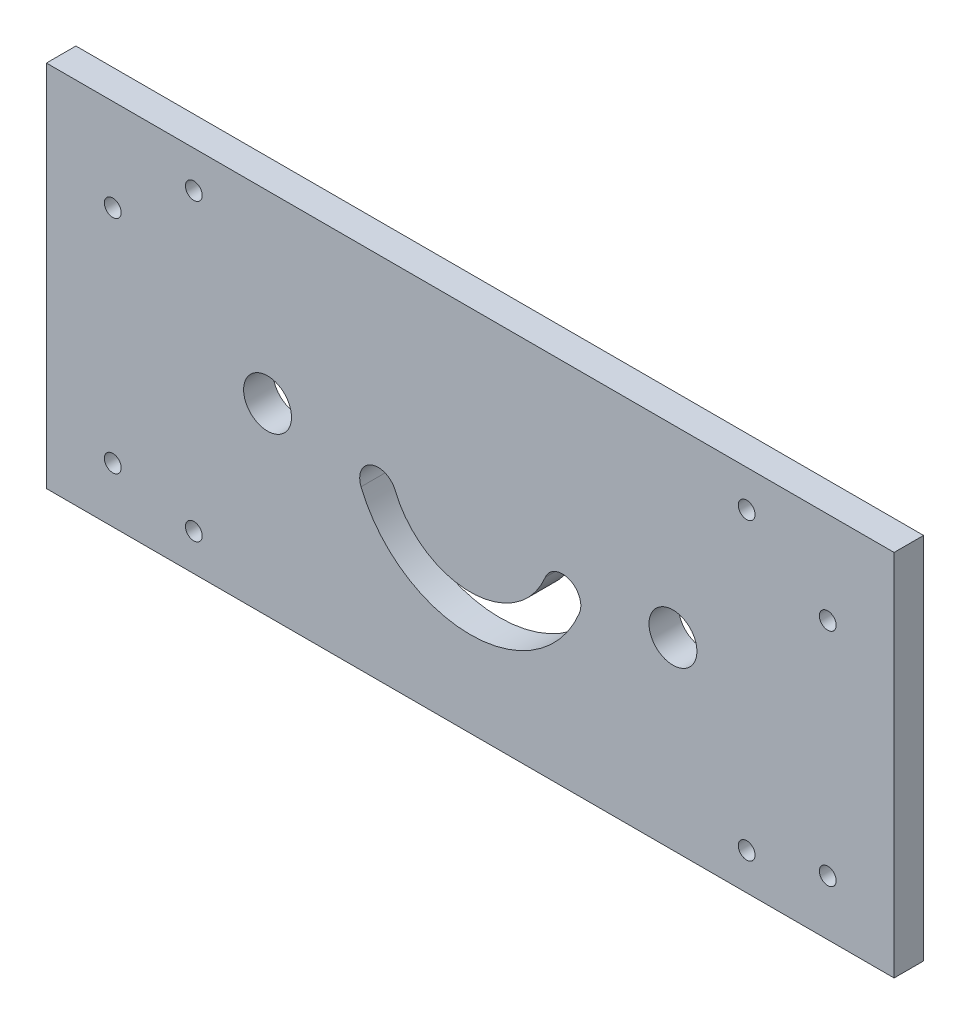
ISO-10303-21;
HEADER;
FILE_DESCRIPTION(('STEP AP214'),'2;1');
FILE_NAME('part.step','',(''),(''),'','','');
FILE_SCHEMA(('AUTOMOTIVE_DESIGN { 1 0 10303 214 1 1 1 1 }'));
ENDSEC;
DATA;
#1=APPLICATION_CONTEXT('core data for automotive mechanical design processes');
#2=APPLICATION_PROTOCOL_DEFINITION('international standard','automotive_design',2000,#1);
#3=PRODUCT_CONTEXT('',#1,'mechanical');
#4=PRODUCT('Part','Part','',(#3));
#5=PRODUCT_RELATED_PRODUCT_CATEGORY('part','',(#4));
#6=PRODUCT_DEFINITION_FORMATION('','',#4);
#7=PRODUCT_DEFINITION_CONTEXT('part definition',#1,'design');
#8=PRODUCT_DEFINITION('design','',#6,#7);
#9=PRODUCT_DEFINITION_SHAPE('','',#8);
#10=(LENGTH_UNIT() NAMED_UNIT(*) SI_UNIT(.MILLI.,.METRE.));
#11=(NAMED_UNIT(*) PLANE_ANGLE_UNIT() SI_UNIT($,.RADIAN.));
#12=(NAMED_UNIT(*) SI_UNIT($,.STERADIAN.) SOLID_ANGLE_UNIT());
#13=UNCERTAINTY_MEASURE_WITH_UNIT(LENGTH_MEASURE(1.E-05),#10,'distance_accuracy_value','');
#14=(GEOMETRIC_REPRESENTATION_CONTEXT(3) GLOBAL_UNCERTAINTY_ASSIGNED_CONTEXT((#13)) GLOBAL_UNIT_ASSIGNED_CONTEXT((#10,
#11,#12)) REPRESENTATION_CONTEXT('',''));
#15=CARTESIAN_POINT('',(0.,0.,0.));
#16=DIRECTION('',(0.,0.,1.));
#17=DIRECTION('',(1.,0.,0.));
#18=AXIS2_PLACEMENT_3D('',#15,#16,#17);
#19=CARTESIAN_POINT('',(0.,0.,8.));
#20=DIRECTION('',(0.,0.,1.));
#21=DIRECTION('',(1.,0.,0.));
#22=AXIS2_PLACEMENT_3D('',#19,#20,#21);
#23=PLANE('',#22);
#24=CARTESIAN_POINT('',(-55.,0.,8.));
#25=DIRECTION('',(0.,0.,1.));
#26=DIRECTION('',(1.,0.,0.));
#27=AXIS2_PLACEMENT_3D('',#24,#25,#26);
#28=CIRCLE('',#27,6.5);
#29=CARTESIAN_POINT('',(-48.5,0.,8.));
#30=VERTEX_POINT('',#29);
#31=EDGE_CURVE('E146',#30,#30,#28,.T.);
#32=ORIENTED_EDGE('',*,*,#31,.F.);
#33=EDGE_LOOP('',(#32));
#34=FACE_BOUND('',#33,.T.);
#35=CARTESIAN_POINT('',(75.,40.,8.));
#36=DIRECTION('',(0.,0.,1.));
#37=DIRECTION('',(1.,0.,0.));
#38=AXIS2_PLACEMENT_3D('',#35,#36,#37);
#39=CIRCLE('',#38,2.28499999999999);
#40=CARTESIAN_POINT('',(77.285,40.,8.));
#41=VERTEX_POINT('',#40);
#42=EDGE_CURVE('E158',#41,#41,#39,.T.);
#43=ORIENTED_EDGE('',*,*,#42,.F.);
#44=EDGE_LOOP('',(#43));
#45=FACE_BOUND('',#44,.T.);
#46=CARTESIAN_POINT('',(97.,-35.,8.));
#47=DIRECTION('',(0.,0.,1.));
#48=DIRECTION('',(-1.,0.,0.));
#49=AXIS2_PLACEMENT_3D('',#46,#47,#48);
#50=CIRCLE('',#49,2.28499999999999);
#51=CARTESIAN_POINT('',(94.715,-35.,8.));
#52=VERTEX_POINT('',#51);
#53=EDGE_CURVE('E170',#52,#52,#50,.T.);
#54=ORIENTED_EDGE('',*,*,#53,.F.);
#55=EDGE_LOOP('',(#54));
#56=FACE_BOUND('',#55,.T.);
#57=CARTESIAN_POINT('',(-97.,25.,8.));
#58=DIRECTION('',(0.,0.,1.));
#59=DIRECTION('',(1.,0.,0.));
#60=AXIS2_PLACEMENT_3D('',#57,#58,#59);
#61=CIRCLE('',#60,2.28499999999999);
#62=CARTESIAN_POINT('',(-94.715,25.,8.));
#63=VERTEX_POINT('',#62);
#64=EDGE_CURVE('E182',#63,#63,#61,.T.);
#65=ORIENTED_EDGE('',*,*,#64,.F.);
#66=EDGE_LOOP('',(#65));
#67=FACE_BOUND('',#66,.T.);
#68=CARTESIAN_POINT('',(-97.,-35.,8.));
#69=DIRECTION('',(0.,0.,1.));
#70=DIRECTION('',(1.,0.,0.));
#71=AXIS2_PLACEMENT_3D('',#68,#69,#70);
#72=CIRCLE('',#71,2.28499999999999);
#73=CARTESIAN_POINT('',(-94.715,-35.,8.));
#74=VERTEX_POINT('',#73);
#75=EDGE_CURVE('E194',#74,#74,#72,.T.);
#76=ORIENTED_EDGE('',*,*,#75,.F.);
#77=EDGE_LOOP('',(#76));
#78=FACE_BOUND('',#77,.T.);
#79=DIRECTION('',(-1.,0.,0.));
#80=VECTOR('',#79,1.);
#81=CARTESIAN_POINT('',(115.,50.,8.));
#82=LINE('',#81,#80);
#83=CARTESIAN_POINT('',(115.,50.,8.));
#84=VERTEX_POINT('',#83);
#85=CARTESIAN_POINT('',(-115.,50.,8.));
#86=VERTEX_POINT('',#85);
#87=EDGE_CURVE('E200',#84,#86,#82,.T.);
#88=ORIENTED_EDGE('',*,*,#87,.T.);
#89=DIRECTION('',(0.,-1.,0.));
#90=VECTOR('',#89,1.);
#91=CARTESIAN_POINT('',(-115.,50.,8.));
#92=LINE('',#91,#90);
#93=CARTESIAN_POINT('',(-115.,-50.,8.));
#94=VERTEX_POINT('',#93);
#95=EDGE_CURVE('E203',#86,#94,#92,.T.);
#96=ORIENTED_EDGE('',*,*,#95,.T.);
#97=DIRECTION('',(1.,0.,0.));
#98=VECTOR('',#97,1.);
#99=CARTESIAN_POINT('',(-115.,-50.,8.));
#100=LINE('',#99,#98);
#101=CARTESIAN_POINT('',(115.,-50.,8.));
#102=VERTEX_POINT('',#101);
#103=EDGE_CURVE('E206',#94,#102,#100,.T.);
#104=ORIENTED_EDGE('',*,*,#103,.T.);
#105=DIRECTION('',(0.,1.,0.));
#106=VECTOR('',#105,1.);
#107=CARTESIAN_POINT('',(115.,-50.,8.));
#108=LINE('',#107,#106);
#109=EDGE_CURVE('E208',#102,#84,#108,.T.);
#110=ORIENTED_EDGE('',*,*,#109,.T.);
#111=EDGE_LOOP('',(#88,#96,#104,#110));
#112=FACE_BOUND('',#111,.T.);
#113=CARTESIAN_POINT('',(-75.,-40.,8.));
#114=DIRECTION('',(0.,0.,1.));
#115=DIRECTION('',(1.,0.,0.));
#116=AXIS2_PLACEMENT_3D('',#113,#114,#115);
#117=CIRCLE('',#116,2.28499999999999);
#118=CARTESIAN_POINT('',(-72.715,-40.,8.));
#119=VERTEX_POINT('',#118);
#120=EDGE_CURVE('E188',#119,#119,#117,.T.);
#121=ORIENTED_EDGE('',*,*,#120,.F.);
#122=EDGE_LOOP('',(#121));
#123=FACE_BOUND('',#122,.T.);
#124=CARTESIAN_POINT('',(75.,-40.,8.));
#125=DIRECTION('',(0.,0.,1.));
#126=DIRECTION('',(-1.,0.,0.));
#127=AXIS2_PLACEMENT_3D('',#124,#125,#126);
#128=CIRCLE('',#127,2.28499999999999);
#129=CARTESIAN_POINT('',(72.715,-40.,8.));
#130=VERTEX_POINT('',#129);
#131=EDGE_CURVE('E176',#130,#130,#128,.T.);
#132=ORIENTED_EDGE('',*,*,#131,.F.);
#133=EDGE_LOOP('',(#132));
#134=FACE_BOUND('',#133,.T.);
#135=CARTESIAN_POINT('',(97.,25.,8.));
#136=DIRECTION('',(0.,0.,1.));
#137=DIRECTION('',(-1.,0.,0.));
#138=AXIS2_PLACEMENT_3D('',#135,#136,#137);
#139=CIRCLE('',#138,2.28499999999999);
#140=CARTESIAN_POINT('',(94.715,25.,8.));
#141=VERTEX_POINT('',#140);
#142=EDGE_CURVE('E164',#141,#141,#139,.T.);
#143=ORIENTED_EDGE('',*,*,#142,.F.);
#144=EDGE_LOOP('',(#143));
#145=FACE_BOUND('',#144,.T.);
#146=CARTESIAN_POINT('',(-75.,40.,8.));
#147=DIRECTION('',(0.,0.,1.));
#148=DIRECTION('',(-1.,0.,0.));
#149=AXIS2_PLACEMENT_3D('',#146,#147,#148);
#150=CIRCLE('',#149,2.28499999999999);
#151=CARTESIAN_POINT('',(-77.285,40.,8.));
#152=VERTEX_POINT('',#151);
#153=EDGE_CURVE('E152',#152,#152,#150,.T.);
#154=ORIENTED_EDGE('',*,*,#153,.F.);
#155=EDGE_LOOP('',(#154));
#156=FACE_BOUND('',#155,.T.);
#157=CARTESIAN_POINT('',(55.,0.,8.));
#158=DIRECTION('',(0.,0.,1.));
#159=DIRECTION('',(-1.,0.,0.));
#160=AXIS2_PLACEMENT_3D('',#157,#158,#159);
#161=CIRCLE('',#160,6.5);
#162=CARTESIAN_POINT('',(48.5,0.,8.));
#163=VERTEX_POINT('',#162);
#164=EDGE_CURVE('E140',#163,#163,#161,.T.);
#165=ORIENTED_EDGE('',*,*,#164,.F.);
#166=EDGE_LOOP('',(#165));
#167=FACE_BOUND('',#166,.T.);
#168=CARTESIAN_POINT('',(0.00750586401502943,5.17961936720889,8.));
#169=DIRECTION('',(0.,0.,1.));
#170=DIRECTION('',(1.,0.,0.));
#171=AXIS2_PLACEMENT_3D('',#168,#169,#170);
#172=CIRCLE('',#171,32.);
#173=CARTESIAN_POINT('',(-29.6310196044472,-6.88511469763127,8.));
#174=VERTEX_POINT('',#173);
#175=CARTESIAN_POINT('',(29.628239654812,-6.92873021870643,8.));
#176=VERTEX_POINT('',#175);
#177=EDGE_CURVE('E112',#174,#176,#172,.T.);
#178=ORIENTED_EDGE('',*,*,#177,.F.);
#179=CARTESIAN_POINT('',(-25.,-5.,8.));
#180=DIRECTION('',(0.,0.,1.));
#181=DIRECTION('',(1.,0.,0.));
#182=AXIS2_PLACEMENT_3D('',#179,#180,#181);
#183=CIRCLE('',#182,5.);
#184=CARTESIAN_POINT('',(-20.3689803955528,-3.11488530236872,8.));
#185=VERTEX_POINT('',#184);
#186=EDGE_CURVE('E104',#185,#174,#183,.T.);
#187=ORIENTED_EDGE('',*,*,#186,.F.);
#188=CARTESIAN_POINT('',(0.00750586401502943,5.17961936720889,8.));
#189=DIRECTION('',(0.,0.,-1.));
#190=DIRECTION('',(1.,0.,0.));
#191=AXIS2_PLACEMENT_3D('',#188,#189,#190);
#192=CIRCLE('',#191,22.);
#193=CARTESIAN_POINT('',(20.371760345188,-3.14487097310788,8.));
#194=VERTEX_POINT('',#193);
#195=EDGE_CURVE('E126',#194,#185,#192,.T.);
#196=ORIENTED_EDGE('',*,*,#195,.F.);
#197=CARTESIAN_POINT('',(25.,-5.03680059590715,8.));
#198=DIRECTION('',(0.,0.,1.));
#199=DIRECTION('',(1.,0.,0.));
#200=AXIS2_PLACEMENT_3D('',#197,#198,#199);
#201=CIRCLE('',#200,5.);
#202=EDGE_CURVE('E124',#176,#194,#201,.T.);
#203=ORIENTED_EDGE('',*,*,#202,.F.);
#204=EDGE_LOOP('',(#178,#187,#196,#203));
#205=FACE_BOUND('',#204,.T.);
#206=ADVANCED_FACE('F39',(#34,#45,#56,#67,#78,#112,#123,#134,#145,#156,#167,#205),#23,.T.);
#207=CARTESIAN_POINT('',(0.,0.,0.));
#208=DIRECTION('',(0.,0.,1.));
#209=DIRECTION('',(1.,0.,0.));
#210=AXIS2_PLACEMENT_3D('',#207,#208,#209);
#211=PLANE('',#210);
#212=CARTESIAN_POINT('',(55.,0.,0.));
#213=DIRECTION('',(0.,0.,1.));
#214=DIRECTION('',(-1.,0.,0.));
#215=AXIS2_PLACEMENT_3D('',#212,#213,#214);
#216=CIRCLE('',#215,6.5);
#217=CARTESIAN_POINT('',(48.5,0.,0.));
#218=VERTEX_POINT('',#217);
#219=EDGE_CURVE('E120',#218,#218,#216,.T.);
#220=ORIENTED_EDGE('',*,*,#219,.T.);
#221=EDGE_LOOP('',(#220));
#222=FACE_BOUND('',#221,.T.);
#223=CARTESIAN_POINT('',(-55.,0.,0.));
#224=DIRECTION('',(0.,0.,1.));
#225=DIRECTION('',(1.,0.,0.));
#226=AXIS2_PLACEMENT_3D('',#223,#224,#225);
#227=CIRCLE('',#226,6.5);
#228=CARTESIAN_POINT('',(-48.5,0.,0.));
#229=VERTEX_POINT('',#228);
#230=EDGE_CURVE('E143',#229,#229,#227,.T.);
#231=ORIENTED_EDGE('',*,*,#230,.T.);
#232=EDGE_LOOP('',(#231));
#233=FACE_BOUND('',#232,.T.);
#234=CARTESIAN_POINT('',(-75.,40.,0.));
#235=DIRECTION('',(0.,0.,1.));
#236=DIRECTION('',(-1.,0.,0.));
#237=AXIS2_PLACEMENT_3D('',#234,#235,#236);
#238=CIRCLE('',#237,2.28499999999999);
#239=CARTESIAN_POINT('',(-77.285,40.,0.));
#240=VERTEX_POINT('',#239);
#241=EDGE_CURVE('E149',#240,#240,#238,.T.);
#242=ORIENTED_EDGE('',*,*,#241,.T.);
#243=EDGE_LOOP('',(#242));
#244=FACE_BOUND('',#243,.T.);
#245=CARTESIAN_POINT('',(75.,40.,0.));
#246=DIRECTION('',(0.,0.,1.));
#247=DIRECTION('',(1.,0.,0.));
#248=AXIS2_PLACEMENT_3D('',#245,#246,#247);
#249=CIRCLE('',#248,2.28499999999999);
#250=CARTESIAN_POINT('',(77.285,40.,0.));
#251=VERTEX_POINT('',#250);
#252=EDGE_CURVE('E155',#251,#251,#249,.T.);
#253=ORIENTED_EDGE('',*,*,#252,.T.);
#254=EDGE_LOOP('',(#253));
#255=FACE_BOUND('',#254,.T.);
#256=CARTESIAN_POINT('',(97.,25.,0.));
#257=DIRECTION('',(0.,0.,1.));
#258=DIRECTION('',(-1.,0.,0.));
#259=AXIS2_PLACEMENT_3D('',#256,#257,#258);
#260=CIRCLE('',#259,2.28499999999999);
#261=CARTESIAN_POINT('',(94.715,25.,0.));
#262=VERTEX_POINT('',#261);
#263=EDGE_CURVE('E161',#262,#262,#260,.T.);
#264=ORIENTED_EDGE('',*,*,#263,.T.);
#265=EDGE_LOOP('',(#264));
#266=FACE_BOUND('',#265,.T.);
#267=CARTESIAN_POINT('',(97.,-35.,0.));
#268=DIRECTION('',(0.,0.,1.));
#269=DIRECTION('',(-1.,0.,0.));
#270=AXIS2_PLACEMENT_3D('',#267,#268,#269);
#271=CIRCLE('',#270,2.28499999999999);
#272=CARTESIAN_POINT('',(94.715,-35.,0.));
#273=VERTEX_POINT('',#272);
#274=EDGE_CURVE('E167',#273,#273,#271,.T.);
#275=ORIENTED_EDGE('',*,*,#274,.T.);
#276=EDGE_LOOP('',(#275));
#277=FACE_BOUND('',#276,.T.);
#278=CARTESIAN_POINT('',(75.,-40.,0.));
#279=DIRECTION('',(0.,0.,1.));
#280=DIRECTION('',(-1.,0.,0.));
#281=AXIS2_PLACEMENT_3D('',#278,#279,#280);
#282=CIRCLE('',#281,2.28499999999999);
#283=CARTESIAN_POINT('',(72.715,-40.,0.));
#284=VERTEX_POINT('',#283);
#285=EDGE_CURVE('E173',#284,#284,#282,.T.);
#286=ORIENTED_EDGE('',*,*,#285,.T.);
#287=EDGE_LOOP('',(#286));
#288=FACE_BOUND('',#287,.T.);
#289=CARTESIAN_POINT('',(-97.,25.,0.));
#290=DIRECTION('',(0.,0.,1.));
#291=DIRECTION('',(1.,0.,0.));
#292=AXIS2_PLACEMENT_3D('',#289,#290,#291);
#293=CIRCLE('',#292,2.28499999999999);
#294=CARTESIAN_POINT('',(-94.715,25.,0.));
#295=VERTEX_POINT('',#294);
#296=EDGE_CURVE('E179',#295,#295,#293,.T.);
#297=ORIENTED_EDGE('',*,*,#296,.T.);
#298=EDGE_LOOP('',(#297));
#299=FACE_BOUND('',#298,.T.);
#300=CARTESIAN_POINT('',(-75.,-40.,0.));
#301=DIRECTION('',(0.,0.,1.));
#302=DIRECTION('',(1.,0.,0.));
#303=AXIS2_PLACEMENT_3D('',#300,#301,#302);
#304=CIRCLE('',#303,2.28499999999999);
#305=CARTESIAN_POINT('',(-72.715,-40.,0.));
#306=VERTEX_POINT('',#305);
#307=EDGE_CURVE('E185',#306,#306,#304,.T.);
#308=ORIENTED_EDGE('',*,*,#307,.T.);
#309=EDGE_LOOP('',(#308));
#310=FACE_BOUND('',#309,.T.);
#311=CARTESIAN_POINT('',(-97.,-35.,0.));
#312=DIRECTION('',(0.,0.,1.));
#313=DIRECTION('',(1.,0.,0.));
#314=AXIS2_PLACEMENT_3D('',#311,#312,#313);
#315=CIRCLE('',#314,2.28499999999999);
#316=CARTESIAN_POINT('',(-94.715,-35.,0.));
#317=VERTEX_POINT('',#316);
#318=EDGE_CURVE('E191',#317,#317,#315,.T.);
#319=ORIENTED_EDGE('',*,*,#318,.T.);
#320=EDGE_LOOP('',(#319));
#321=FACE_BOUND('',#320,.T.);
#322=DIRECTION('',(-1.,0.,0.));
#323=VECTOR('',#322,1.);
#324=CARTESIAN_POINT('',(115.,50.,0.));
#325=LINE('',#324,#323);
#326=CARTESIAN_POINT('',(115.,50.,0.));
#327=VERTEX_POINT('',#326);
#328=CARTESIAN_POINT('',(-115.,50.,0.));
#329=VERTEX_POINT('',#328);
#330=EDGE_CURVE('E197',#327,#329,#325,.T.);
#331=ORIENTED_EDGE('',*,*,#330,.F.);
#332=DIRECTION('',(0.,1.,0.));
#333=VECTOR('',#332,1.);
#334=CARTESIAN_POINT('',(115.,-50.,0.));
#335=LINE('',#334,#333);
#336=CARTESIAN_POINT('',(115.,-50.,0.));
#337=VERTEX_POINT('',#336);
#338=EDGE_CURVE('E204',#337,#327,#335,.T.);
#339=ORIENTED_EDGE('',*,*,#338,.F.);
#340=DIRECTION('',(1.,0.,0.));
#341=VECTOR('',#340,1.);
#342=CARTESIAN_POINT('',(-115.,-50.,0.));
#343=LINE('',#342,#341);
#344=CARTESIAN_POINT('',(-115.,-50.,0.));
#345=VERTEX_POINT('',#344);
#346=EDGE_CURVE('E215',#345,#337,#343,.T.);
#347=ORIENTED_EDGE('',*,*,#346,.F.);
#348=DIRECTION('',(0.,-1.,0.));
#349=VECTOR('',#348,1.);
#350=CARTESIAN_POINT('',(-115.,50.,0.));
#351=LINE('',#350,#349);
#352=EDGE_CURVE('E213',#329,#345,#351,.T.);
#353=ORIENTED_EDGE('',*,*,#352,.F.);
#354=EDGE_LOOP('',(#331,#339,#347,#353));
#355=FACE_BOUND('',#354,.T.);
#356=CARTESIAN_POINT('',(-25.,-5.,0.));
#357=DIRECTION('',(0.,0.,1.));
#358=DIRECTION('',(1.,0.,0.));
#359=AXIS2_PLACEMENT_3D('',#356,#357,#358);
#360=CIRCLE('',#359,5.);
#361=CARTESIAN_POINT('',(-20.3689803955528,-3.11488530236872,0.));
#362=VERTEX_POINT('',#361);
#363=CARTESIAN_POINT('',(-29.6310196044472,-6.88511469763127,0.));
#364=VERTEX_POINT('',#363);
#365=EDGE_CURVE('E62',#362,#364,#360,.T.);
#366=ORIENTED_EDGE('',*,*,#365,.T.);
#367=CARTESIAN_POINT('',(0.00750586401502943,5.17961936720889,0.));
#368=DIRECTION('',(0.,0.,1.));
#369=DIRECTION('',(1.,0.,0.));
#370=AXIS2_PLACEMENT_3D('',#367,#368,#369);
#371=CIRCLE('',#370,32.);
#372=CARTESIAN_POINT('',(29.628239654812,-6.92873021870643,0.));
#373=VERTEX_POINT('',#372);
#374=EDGE_CURVE('E119',#364,#373,#371,.T.);
#375=ORIENTED_EDGE('',*,*,#374,.T.);
#376=CARTESIAN_POINT('',(25.,-5.03680059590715,0.));
#377=DIRECTION('',(0.,0.,1.));
#378=DIRECTION('',(1.,0.,0.));
#379=AXIS2_PLACEMENT_3D('',#376,#377,#378);
#380=CIRCLE('',#379,5.);
#381=CARTESIAN_POINT('',(20.371760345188,-3.14487097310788,0.));
#382=VERTEX_POINT('',#381);
#383=EDGE_CURVE('E132',#373,#382,#380,.T.);
#384=ORIENTED_EDGE('',*,*,#383,.T.);
#385=CARTESIAN_POINT('',(0.00750586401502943,5.17961936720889,0.));
#386=DIRECTION('',(0.,0.,-1.));
#387=DIRECTION('',(1.,0.,0.));
#388=AXIS2_PLACEMENT_3D('',#385,#386,#387);
#389=CIRCLE('',#388,22.);
#390=EDGE_CURVE('E113',#382,#362,#389,.T.);
#391=ORIENTED_EDGE('',*,*,#390,.T.);
#392=EDGE_LOOP('',(#366,#375,#384,#391));
#393=FACE_BOUND('',#392,.T.);
#394=ADVANCED_FACE('F233',(#222,#233,#244,#255,#266,#277,#288,#299,#310,#321,#355,#393),#211,.F.);
#395=CARTESIAN_POINT('',(115.,50.,8.));
#396=DIRECTION('',(0.,-1.,0.));
#397=DIRECTION('',(0.,0.,-1.));
#398=AXIS2_PLACEMENT_3D('',#395,#396,#397);
#399=PLANE('',#398);
#400=ORIENTED_EDGE('',*,*,#330,.T.);
#401=DIRECTION('',(0.,0.,-1.));
#402=VECTOR('',#401,1.);
#403=CARTESIAN_POINT('',(-115.,50.,8.));
#404=LINE('',#403,#402);
#405=EDGE_CURVE('E11',#86,#329,#404,.T.);
#406=ORIENTED_EDGE('',*,*,#405,.F.);
#407=ORIENTED_EDGE('',*,*,#87,.F.);
#408=DIRECTION('',(0.,0.,-1.));
#409=VECTOR('',#408,1.);
#410=CARTESIAN_POINT('',(115.,50.,8.));
#411=LINE('',#410,#409);
#412=EDGE_CURVE('E210',#84,#327,#411,.T.);
#413=ORIENTED_EDGE('',*,*,#412,.T.);
#414=EDGE_LOOP('',(#400,#406,#407,#413));
#415=FACE_BOUND('',#414,.T.);
#416=ADVANCED_FACE('F41',(#415),#399,.F.);
#417=CARTESIAN_POINT('',(-115.,50.,8.));
#418=DIRECTION('',(1.,0.,0.));
#419=DIRECTION('',(0.,0.,-1.));
#420=AXIS2_PLACEMENT_3D('',#417,#418,#419);
#421=PLANE('',#420);
#422=ORIENTED_EDGE('',*,*,#352,.T.);
#423=DIRECTION('',(0.,0.,-1.));
#424=VECTOR('',#423,1.);
#425=CARTESIAN_POINT('',(-115.,-50.,8.));
#426=LINE('',#425,#424);
#427=EDGE_CURVE('E47',#94,#345,#426,.T.);
#428=ORIENTED_EDGE('',*,*,#427,.F.);
#429=ORIENTED_EDGE('',*,*,#95,.F.);
#430=ORIENTED_EDGE('',*,*,#405,.T.);
#431=EDGE_LOOP('',(#422,#428,#429,#430));
#432=FACE_BOUND('',#431,.T.);
#433=ADVANCED_FACE('F244',(#432),#421,.F.);
#434=CARTESIAN_POINT('',(-115.,-50.,8.));
#435=DIRECTION('',(0.,1.,0.));
#436=DIRECTION('',(-1.,0.,0.));
#437=AXIS2_PLACEMENT_3D('',#434,#435,#436);
#438=PLANE('',#437);
#439=ORIENTED_EDGE('',*,*,#346,.T.);
#440=DIRECTION('',(0.,0.,-1.));
#441=VECTOR('',#440,1.);
#442=CARTESIAN_POINT('',(115.,-50.,8.));
#443=LINE('',#442,#441);
#444=EDGE_CURVE('E220',#102,#337,#443,.T.);
#445=ORIENTED_EDGE('',*,*,#444,.F.);
#446=ORIENTED_EDGE('',*,*,#103,.F.);
#447=ORIENTED_EDGE('',*,*,#427,.T.);
#448=EDGE_LOOP('',(#439,#445,#446,#447));
#449=FACE_BOUND('',#448,.T.);
#450=ADVANCED_FACE('F227',(#449),#438,.F.);
#451=CARTESIAN_POINT('',(115.,-50.,8.));
#452=DIRECTION('',(-1.,0.,0.));
#453=DIRECTION('',(0.,0.,1.));
#454=AXIS2_PLACEMENT_3D('',#451,#452,#453);
#455=PLANE('',#454);
#456=ORIENTED_EDGE('',*,*,#338,.T.);
#457=ORIENTED_EDGE('',*,*,#412,.F.);
#458=ORIENTED_EDGE('',*,*,#109,.F.);
#459=ORIENTED_EDGE('',*,*,#444,.T.);
#460=EDGE_LOOP('',(#456,#457,#458,#459));
#461=FACE_BOUND('',#460,.T.);
#462=ADVANCED_FACE('F237',(#461),#455,.F.);
#463=CARTESIAN_POINT('',(-97.,-35.,8.));
#464=DIRECTION('',(0.,0.,-1.));
#465=DIRECTION('',(-1.,0.,0.));
#466=AXIS2_PLACEMENT_3D('',#463,#464,#465);
#467=CYLINDRICAL_SURFACE('',#466,2.28499999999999);
#468=ORIENTED_EDGE('',*,*,#75,.T.);
#469=EDGE_LOOP('',(#468));
#470=FACE_BOUND('',#469,.T.);
#471=ORIENTED_EDGE('',*,*,#318,.F.);
#472=EDGE_LOOP('',(#471));
#473=FACE_BOUND('',#472,.T.);
#474=ADVANCED_FACE('F262',(#470,#473),#467,.F.);
#475=CARTESIAN_POINT('',(-75.,-40.,8.));
#476=DIRECTION('',(0.,0.,-1.));
#477=DIRECTION('',(-1.,0.,0.));
#478=AXIS2_PLACEMENT_3D('',#475,#476,#477);
#479=CYLINDRICAL_SURFACE('',#478,2.28499999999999);
#480=ORIENTED_EDGE('',*,*,#120,.T.);
#481=EDGE_LOOP('',(#480));
#482=FACE_BOUND('',#481,.T.);
#483=ORIENTED_EDGE('',*,*,#307,.F.);
#484=EDGE_LOOP('',(#483));
#485=FACE_BOUND('',#484,.T.);
#486=ADVANCED_FACE('F269',(#482,#485),#479,.F.);
#487=CARTESIAN_POINT('',(-97.,25.,8.));
#488=DIRECTION('',(0.,0.,-1.));
#489=DIRECTION('',(-1.,0.,0.));
#490=AXIS2_PLACEMENT_3D('',#487,#488,#489);
#491=CYLINDRICAL_SURFACE('',#490,2.28499999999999);
#492=ORIENTED_EDGE('',*,*,#64,.T.);
#493=EDGE_LOOP('',(#492));
#494=FACE_BOUND('',#493,.T.);
#495=ORIENTED_EDGE('',*,*,#296,.F.);
#496=EDGE_LOOP('',(#495));
#497=FACE_BOUND('',#496,.T.);
#498=ADVANCED_FACE('F274',(#494,#497),#491,.F.);
#499=CARTESIAN_POINT('',(75.,-40.,8.));
#500=DIRECTION('',(0.,0.,-1.));
#501=DIRECTION('',(-1.,0.,0.));
#502=AXIS2_PLACEMENT_3D('',#499,#500,#501);
#503=CYLINDRICAL_SURFACE('',#502,2.28499999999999);
#504=ORIENTED_EDGE('',*,*,#131,.T.);
#505=EDGE_LOOP('',(#504));
#506=FACE_BOUND('',#505,.T.);
#507=ORIENTED_EDGE('',*,*,#285,.F.);
#508=EDGE_LOOP('',(#507));
#509=FACE_BOUND('',#508,.T.);
#510=ADVANCED_FACE('F284',(#506,#509),#503,.F.);
#511=CARTESIAN_POINT('',(97.,-35.,8.));
#512=DIRECTION('',(0.,0.,-1.));
#513=DIRECTION('',(-1.,0.,0.));
#514=AXIS2_PLACEMENT_3D('',#511,#512,#513);
#515=CYLINDRICAL_SURFACE('',#514,2.28499999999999);
#516=ORIENTED_EDGE('',*,*,#53,.T.);
#517=EDGE_LOOP('',(#516));
#518=FACE_BOUND('',#517,.T.);
#519=ORIENTED_EDGE('',*,*,#274,.F.);
#520=EDGE_LOOP('',(#519));
#521=FACE_BOUND('',#520,.T.);
#522=ADVANCED_FACE('F291',(#518,#521),#515,.F.);
#523=CARTESIAN_POINT('',(97.,25.,8.));
#524=DIRECTION('',(0.,0.,-1.));
#525=DIRECTION('',(-1.,0.,0.));
#526=AXIS2_PLACEMENT_3D('',#523,#524,#525);
#527=CYLINDRICAL_SURFACE('',#526,2.28499999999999);
#528=ORIENTED_EDGE('',*,*,#142,.T.);
#529=EDGE_LOOP('',(#528));
#530=FACE_BOUND('',#529,.T.);
#531=ORIENTED_EDGE('',*,*,#263,.F.);
#532=EDGE_LOOP('',(#531));
#533=FACE_BOUND('',#532,.T.);
#534=ADVANCED_FACE('F295',(#530,#533),#527,.F.);
#535=CARTESIAN_POINT('',(75.,40.,8.));
#536=DIRECTION('',(0.,0.,-1.));
#537=DIRECTION('',(-1.,0.,0.));
#538=AXIS2_PLACEMENT_3D('',#535,#536,#537);
#539=CYLINDRICAL_SURFACE('',#538,2.28499999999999);
#540=ORIENTED_EDGE('',*,*,#42,.T.);
#541=EDGE_LOOP('',(#540));
#542=FACE_BOUND('',#541,.T.);
#543=ORIENTED_EDGE('',*,*,#252,.F.);
#544=EDGE_LOOP('',(#543));
#545=FACE_BOUND('',#544,.T.);
#546=ADVANCED_FACE('F299',(#542,#545),#539,.F.);
#547=CARTESIAN_POINT('',(-75.,40.,8.));
#548=DIRECTION('',(0.,0.,-1.));
#549=DIRECTION('',(-1.,0.,0.));
#550=AXIS2_PLACEMENT_3D('',#547,#548,#549);
#551=CYLINDRICAL_SURFACE('',#550,2.28499999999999);
#552=ORIENTED_EDGE('',*,*,#153,.T.);
#553=EDGE_LOOP('',(#552));
#554=FACE_BOUND('',#553,.T.);
#555=ORIENTED_EDGE('',*,*,#241,.F.);
#556=EDGE_LOOP('',(#555));
#557=FACE_BOUND('',#556,.T.);
#558=ADVANCED_FACE('F303',(#554,#557),#551,.F.);
#559=CARTESIAN_POINT('',(-55.,0.,8.));
#560=DIRECTION('',(0.,0.,-1.));
#561=DIRECTION('',(-1.,0.,0.));
#562=AXIS2_PLACEMENT_3D('',#559,#560,#561);
#563=CYLINDRICAL_SURFACE('',#562,6.5);
#564=ORIENTED_EDGE('',*,*,#31,.T.);
#565=EDGE_LOOP('',(#564));
#566=FACE_BOUND('',#565,.T.);
#567=ORIENTED_EDGE('',*,*,#230,.F.);
#568=EDGE_LOOP('',(#567));
#569=FACE_BOUND('',#568,.T.);
#570=ADVANCED_FACE('F307',(#566,#569),#563,.F.);
#571=CARTESIAN_POINT('',(55.,0.,8.));
#572=DIRECTION('',(0.,0.,-1.));
#573=DIRECTION('',(-1.,0.,0.));
#574=AXIS2_PLACEMENT_3D('',#571,#572,#573);
#575=CYLINDRICAL_SURFACE('',#574,6.5);
#576=ORIENTED_EDGE('',*,*,#164,.T.);
#577=EDGE_LOOP('',(#576));
#578=FACE_BOUND('',#577,.T.);
#579=ORIENTED_EDGE('',*,*,#219,.F.);
#580=EDGE_LOOP('',(#579));
#581=FACE_BOUND('',#580,.T.);
#582=ADVANCED_FACE('F311',(#578,#581),#575,.F.);
#583=CARTESIAN_POINT('',(-25.,-5.,8.));
#584=DIRECTION('',(0.,0.,-1.));
#585=DIRECTION('',(-1.,0.,0.));
#586=AXIS2_PLACEMENT_3D('',#583,#584,#585);
#587=CYLINDRICAL_SURFACE('',#586,5.);
#588=ORIENTED_EDGE('',*,*,#365,.F.);
#589=DIRECTION('',(0.,0.,-1.));
#590=VECTOR('',#589,1.);
#591=CARTESIAN_POINT('',(-20.3689803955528,-3.11488530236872,8.));
#592=LINE('',#591,#590);
#593=EDGE_CURVE('E108',#185,#362,#592,.T.);
#594=ORIENTED_EDGE('',*,*,#593,.F.);
#595=ORIENTED_EDGE('',*,*,#186,.T.);
#596=DIRECTION('',(0.,0.,-1.));
#597=VECTOR('',#596,1.);
#598=CARTESIAN_POINT('',(-29.6310196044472,-6.88511469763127,8.));
#599=LINE('',#598,#597);
#600=EDGE_CURVE('E107',#174,#364,#599,.T.);
#601=ORIENTED_EDGE('',*,*,#600,.T.);
#602=EDGE_LOOP('',(#588,#594,#595,#601));
#603=FACE_BOUND('',#602,.T.);
#604=ADVANCED_FACE('F106',(#603),#587,.F.);
#605=CARTESIAN_POINT('',(0.00750586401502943,5.17961936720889,8.));
#606=DIRECTION('',(0.,0.,-1.));
#607=DIRECTION('',(-1.,0.,0.));
#608=AXIS2_PLACEMENT_3D('',#605,#606,#607);
#609=CYLINDRICAL_SURFACE('',#608,32.);
#610=ORIENTED_EDGE('',*,*,#374,.F.);
#611=ORIENTED_EDGE('',*,*,#600,.F.);
#612=ORIENTED_EDGE('',*,*,#177,.T.);
#613=DIRECTION('',(0.,0.,-1.));
#614=VECTOR('',#613,1.);
#615=CARTESIAN_POINT('',(29.628239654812,-6.92873021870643,8.));
#616=LINE('',#615,#614);
#617=EDGE_CURVE('E121',#176,#373,#616,.T.);
#618=ORIENTED_EDGE('',*,*,#617,.T.);
#619=EDGE_LOOP('',(#610,#611,#612,#618));
#620=FACE_BOUND('',#619,.T.);
#621=ADVANCED_FACE('F116',(#620),#609,.F.);
#622=CARTESIAN_POINT('',(25.,-5.03680059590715,8.));
#623=DIRECTION('',(0.,0.,-1.));
#624=DIRECTION('',(-1.,0.,0.));
#625=AXIS2_PLACEMENT_3D('',#622,#623,#624);
#626=CYLINDRICAL_SURFACE('',#625,5.);
#627=ORIENTED_EDGE('',*,*,#383,.F.);
#628=ORIENTED_EDGE('',*,*,#617,.F.);
#629=ORIENTED_EDGE('',*,*,#202,.T.);
#630=DIRECTION('',(0.,0.,-1.));
#631=VECTOR('',#630,1.);
#632=CARTESIAN_POINT('',(20.371760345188,-3.14487097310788,8.));
#633=LINE('',#632,#631);
#634=EDGE_CURVE('E54',#194,#382,#633,.T.);
#635=ORIENTED_EDGE('',*,*,#634,.T.);
#636=EDGE_LOOP('',(#627,#628,#629,#635));
#637=FACE_BOUND('',#636,.T.);
#638=ADVANCED_FACE('F320',(#637),#626,.F.);
#639=CARTESIAN_POINT('',(0.00750586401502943,5.17961936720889,8.));
#640=DIRECTION('',(0.,0.,-1.));
#641=DIRECTION('',(-1.,0.,0.));
#642=AXIS2_PLACEMENT_3D('',#639,#640,#641);
#643=CYLINDRICAL_SURFACE('',#642,22.);
#644=ORIENTED_EDGE('',*,*,#390,.F.);
#645=ORIENTED_EDGE('',*,*,#634,.F.);
#646=ORIENTED_EDGE('',*,*,#195,.T.);
#647=ORIENTED_EDGE('',*,*,#593,.T.);
#648=EDGE_LOOP('',(#644,#645,#646,#647));
#649=FACE_BOUND('',#648,.T.);
#650=ADVANCED_FACE('F323',(#649),#643,.T.);
#651=CLOSED_SHELL('',(#206,#394,#416,#433,#450,#462,#474,#486,#498,#510,#522,#534,#546,#558,
#570,#582,#604,#621,#638,#650));
#652=MANIFOLD_SOLID_BREP('B2',#651);
#653=ADVANCED_BREP_SHAPE_REPRESENTATION('',(#18,#652),#14);
#654=SHAPE_DEFINITION_REPRESENTATION(#9,#653);
ENDSEC;
END-ISO-10303-21;
